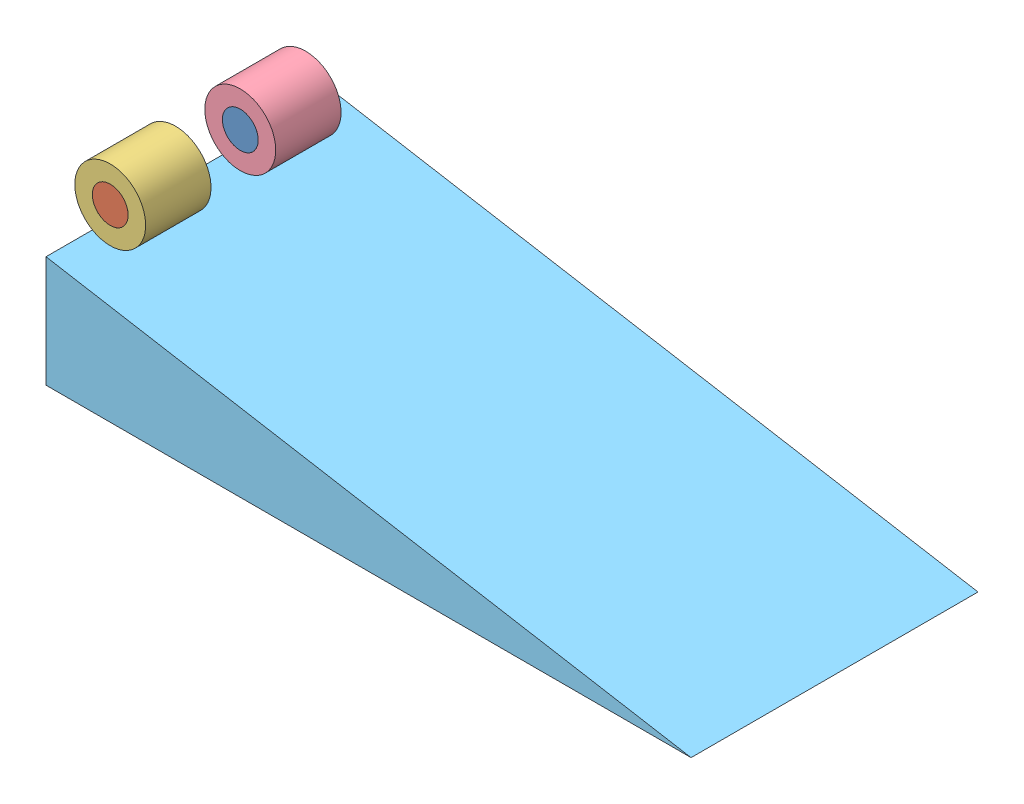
SolidWorks assembly cylindrePlateauMomentInertie.SLDASM, configuration Défaut (file format 8000). Lengths in mm.
Overall size (607.67 173.02 259).
5 component instances, 5 part files, 6 mates.
Components (placement in the parent):
- centre1CyclindreCompose-1: centre1CyclindreCompose.sldprt [Défaut] at (-266.9629 94.0122 60.1562) x (0.877343 0.479863 0) z (0 0 1) size (32.36 32.36 59)
- centreCyclindreCompose1-1: centreCyclindreCompose1.sldprt [Défaut] at (-266.9885 94.0167 177.525) x (0.991704 -0.128541 0) z (0 0 1) size (32.36 32.36 59)
- cylindre4-1: cylindre4.SLDPRT [Défaut] at (-266.9885 94.0167 118.525) x (0.970182 -0.242378 0) z (0 0 1) size (63.97 63.97 59)
- cylindre5-1: cylindre5.SLDPRT [Défaut] at (-266.9629 94.0122 1.1562) x (0.88482 0.465933 0) z (0 0 1) size (63.97 63.97 59)
- plateau-1: plateau.SLDPRT [Défaut] at (-142.8315 -8.6141 117.6988) size (582.29 100.44 259)
Mates (geometry in assembly coordinates):
- Coaxiale1: concentric: cylinder of centreCyclindreCompose1-1 through (-266.9885 94.0168 72.7648) axis (0 0 1) radius 16.1787; cylinder of cylindre4-1 through (-266.9885 94.0168 177.525) axis (0 0 -1) radius 16.1787
- Coïncidente1: coincident: plane of centreCyclindreCompose1-1 through (-266.9885 94.0168 177.525) normal (0 0 1); plane of cylindre4-1 through (-266.9885 94.0168 177.525) normal (0 0 1)
- Coaxiale2: concentric: cylinder of centre1CyclindreCompose-1 through (-266.9629 94.0122 -44.604) axis (0 0 1) radius 16.1787; cylinder of cylindre5-1 through (-266.9629 94.0122 60.1562) axis (0 0 -1) radius 16.1787
- Coïncidente2: coincident: plane of centre1CyclindreCompose-1 through (-266.9629 94.0122 60.1562) normal (0 0 1); plane of cylindre5-1 through (-266.9629 94.0122 60.1562) normal (0 0 1)
- Tangent1: tangent: cylinder of cylindre4-1 through (234.5717 5.3434 177.525) axis (0 0 -1) radius 31.9829; plane of plateau-1 through (-284.7857 64.6313 -41.3012) normal (0.169979 0.985448 0)
- Tangent2: tangent: cylinder of cylindre5-1 through (47.5486 37.6033 60.1562) axis (0 0 -1) radius 31.9829; plane of plateau-1 through (-284.7857 64.6313 -41.3012) normal (0.169979 0.985448 0)
